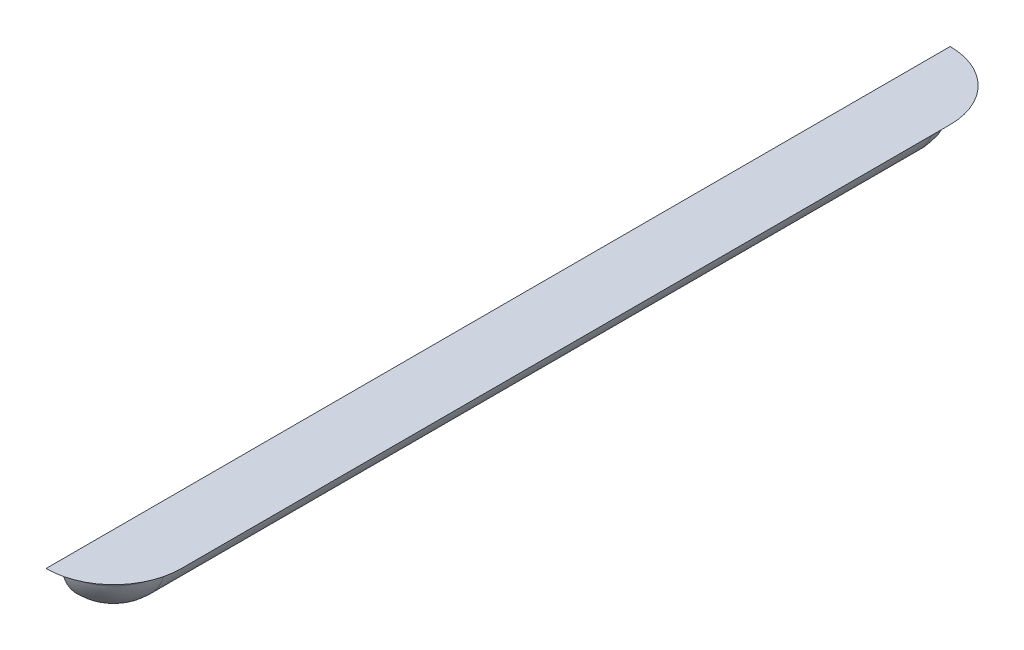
ISO-10303-21;
HEADER;
FILE_DESCRIPTION(('STEP AP214'),'2;1');
FILE_NAME('part.step','',(''),(''),'','','');
FILE_SCHEMA(('AUTOMOTIVE_DESIGN { 1 0 10303 214 1 1 1 1 }'));
ENDSEC;
DATA;
#1=APPLICATION_CONTEXT('core data for automotive mechanical design processes');
#2=APPLICATION_PROTOCOL_DEFINITION('international standard','automotive_design',2000,#1);
#3=PRODUCT_CONTEXT('',#1,'mechanical');
#4=PRODUCT('Part','Part','',(#3));
#5=PRODUCT_RELATED_PRODUCT_CATEGORY('part','',(#4));
#6=PRODUCT_DEFINITION_FORMATION('','',#4);
#7=PRODUCT_DEFINITION_CONTEXT('part definition',#1,'design');
#8=PRODUCT_DEFINITION('design','',#6,#7);
#9=PRODUCT_DEFINITION_SHAPE('','',#8);
#10=(LENGTH_UNIT() NAMED_UNIT(*) SI_UNIT(.MILLI.,.METRE.));
#11=(NAMED_UNIT(*) PLANE_ANGLE_UNIT() SI_UNIT($,.RADIAN.));
#12=(NAMED_UNIT(*) SI_UNIT($,.STERADIAN.) SOLID_ANGLE_UNIT());
#13=UNCERTAINTY_MEASURE_WITH_UNIT(LENGTH_MEASURE(1.E-05),#10,'distance_accuracy_value','');
#14=(GEOMETRIC_REPRESENTATION_CONTEXT(3) GLOBAL_UNCERTAINTY_ASSIGNED_CONTEXT((#13)) GLOBAL_UNIT_ASSIGNED_CONTEXT((#10,
#11,#12)) REPRESENTATION_CONTEXT('',''));
#15=CARTESIAN_POINT('',(0.,0.,0.));
#16=DIRECTION('',(0.,0.,1.));
#17=DIRECTION('',(1.,0.,0.));
#18=AXIS2_PLACEMENT_3D('',#15,#16,#17);
#19=CARTESIAN_POINT('',(-3.,0.,44.));
#20=DIRECTION('',(1.,0.,0.));
#21=DIRECTION('',(0.,0.,-1.));
#22=AXIS2_PLACEMENT_3D('',#19,#20,#21);
#23=PLANE('',#22);
#24=DIRECTION('',(0.,0.,-1.));
#25=VECTOR('',#24,1.);
#26=CARTESIAN_POINT('',(-3.,0.,44.));
#27=LINE('',#26,#25);
#28=CARTESIAN_POINT('',(-3.,0.,51.7459666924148));
#29=VERTEX_POINT('',#28);
#30=CARTESIAN_POINT('',(-3.,0.,-51.7459666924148));
#31=VERTEX_POINT('',#30);
#32=EDGE_CURVE('E93',#29,#31,#27,.T.);
#33=ORIENTED_EDGE('',*,*,#32,.T.);
#34=CARTESIAN_POINT('',(-3.,-2.,-51.7459666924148));
#35=DIRECTION('',(1.,0.,0.));
#36=DIRECTION('',(0.,0.,-1.));
#37=AXIS2_PLACEMENT_3D('',#34,#35,#36);
#38=CIRCLE('',#37,2.);
#39=CARTESIAN_POINT('',(-3.00000000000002,-1.5,-49.8094750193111));
#40=VERTEX_POINT('',#39);
#41=EDGE_CURVE('E12',#31,#40,#38,.T.);
#42=ORIENTED_EDGE('',*,*,#41,.T.);
#43=CARTESIAN_POINT('',(-3.,0.,-44.));
#44=DIRECTION('',(-1.,0.,0.));
#45=DIRECTION('',(0.,0.,1.));
#46=AXIS2_PLACEMENT_3D('',#43,#44,#45);
#47=CIRCLE('',#46,6.);
#48=CARTESIAN_POINT('',(-3.,-6.,-44.));
#49=VERTEX_POINT('',#48);
#50=EDGE_CURVE('E126',#40,#49,#47,.T.);
#51=ORIENTED_EDGE('',*,*,#50,.T.);
#52=DIRECTION('',(0.,0.,-1.));
#53=VECTOR('',#52,1.);
#54=CARTESIAN_POINT('',(-3.,-6.,44.));
#55=LINE('',#54,#53);
#56=CARTESIAN_POINT('',(-3.,-6.,44.));
#57=VERTEX_POINT('',#56);
#58=EDGE_CURVE('E122',#57,#49,#55,.T.);
#59=ORIENTED_EDGE('',*,*,#58,.F.);
#60=CARTESIAN_POINT('',(-3.,0.,44.));
#61=DIRECTION('',(-1.,0.,0.));
#62=DIRECTION('',(0.,0.,1.));
#63=AXIS2_PLACEMENT_3D('',#60,#61,#62);
#64=CIRCLE('',#63,6.);
#65=CARTESIAN_POINT('',(-3.00000000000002,-1.5,49.8094750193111));
#66=VERTEX_POINT('',#65);
#67=EDGE_CURVE('E120',#57,#66,#64,.T.);
#68=ORIENTED_EDGE('',*,*,#67,.T.);
#69=CARTESIAN_POINT('',(-3.,-2.,51.7459666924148));
#70=DIRECTION('',(1.,0.,0.));
#71=DIRECTION('',(0.,0.,-1.));
#72=AXIS2_PLACEMENT_3D('',#69,#70,#71);
#73=CIRCLE('',#72,2.);
#74=EDGE_CURVE('E48',#66,#29,#73,.T.);
#75=ORIENTED_EDGE('',*,*,#74,.T.);
#76=EDGE_LOOP('',(#33,#42,#51,#59,#68,#75));
#77=FACE_BOUND('',#76,.T.);
#78=ADVANCED_FACE('F39',(#77),#23,.F.);
#79=CARTESIAN_POINT('',(-3.,0.,44.));
#80=DIRECTION('',(0.,0.,-1.));
#81=DIRECTION('',(-1.,0.,0.));
#82=AXIS2_PLACEMENT_3D('',#79,#80,#81);
#83=CYLINDRICAL_SURFACE('',#82,6.);
#84=CARTESIAN_POINT('',(-3.,0.,-44.));
#85=DIRECTION('',(0.,0.,1.));
#86=DIRECTION('',(1.,0.,0.));
#87=AXIS2_PLACEMENT_3D('',#84,#85,#86);
#88=CIRCLE('',#87,6.);
#89=CARTESIAN_POINT('',(2.80947501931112,-1.5,-44.));
#90=VERTEX_POINT('',#89);
#91=EDGE_CURVE('E125',#49,#90,#88,.T.);
#92=ORIENTED_EDGE('',*,*,#91,.T.);
#93=DIRECTION('',(0.,0.,-1.));
#94=VECTOR('',#93,1.);
#95=CARTESIAN_POINT('',(2.80947501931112,-1.5,44.));
#96=LINE('',#95,#94);
#97=CARTESIAN_POINT('',(2.80947501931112,-1.5,44.));
#98=VERTEX_POINT('',#97);
#99=EDGE_CURVE('E114',#90,#98,#96,.F.);
#100=ORIENTED_EDGE('',*,*,#99,.T.);
#101=CARTESIAN_POINT('',(-3.,0.,44.));
#102=DIRECTION('',(0.,0.,1.));
#103=DIRECTION('',(1.,0.,0.));
#104=AXIS2_PLACEMENT_3D('',#101,#102,#103);
#105=CIRCLE('',#104,6.);
#106=EDGE_CURVE('E128',#57,#98,#105,.T.);
#107=ORIENTED_EDGE('',*,*,#106,.F.);
#108=ORIENTED_EDGE('',*,*,#58,.T.);
#109=EDGE_LOOP('',(#92,#100,#107,#108));
#110=FACE_BOUND('',#109,.T.);
#111=ADVANCED_FACE('F134',(#110),#83,.T.);
#112=CARTESIAN_POINT('',(-3.,0.,44.));
#113=DIRECTION('',(0.,1.,0.));
#114=DIRECTION('',(0.,0.,1.));
#115=AXIS2_PLACEMENT_3D('',#112,#113,#114);
#116=SPHERICAL_SURFACE('',#115,6.);
#117=ORIENTED_EDGE('',*,*,#106,.T.);
#118=CARTESIAN_POINT('',(-3.,-1.5,44.));
#119=DIRECTION('',(0.,1.,0.));
#120=DIRECTION('',(0.,0.,1.));
#121=AXIS2_PLACEMENT_3D('',#118,#119,#120);
#122=CIRCLE('',#121,5.80947501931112);
#123=EDGE_CURVE('E97',#98,#66,#122,.F.);
#124=ORIENTED_EDGE('',*,*,#123,.T.);
#125=ORIENTED_EDGE('',*,*,#67,.F.);
#126=EDGE_LOOP('',(#117,#124,#125));
#127=FACE_BOUND('',#126,.T.);
#128=ADVANCED_FACE('F135',(#127),#116,.T.);
#129=CARTESIAN_POINT('',(-3.,0.,-44.));
#130=DIRECTION('',(0.,-1.,0.));
#131=DIRECTION('',(0.,0.,-1.));
#132=AXIS2_PLACEMENT_3D('',#129,#130,#131);
#133=SPHERICAL_SURFACE('',#132,6.);
#134=ORIENTED_EDGE('',*,*,#50,.F.);
#135=CARTESIAN_POINT('',(-3.,-1.5,-44.));
#136=DIRECTION('',(0.,1.,0.));
#137=DIRECTION('',(0.,0.,1.));
#138=AXIS2_PLACEMENT_3D('',#135,#136,#137);
#139=CIRCLE('',#138,5.80947501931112);
#140=EDGE_CURVE('E61',#40,#90,#139,.F.);
#141=ORIENTED_EDGE('',*,*,#140,.T.);
#142=ORIENTED_EDGE('',*,*,#91,.F.);
#143=EDGE_LOOP('',(#134,#141,#142));
#144=FACE_BOUND('',#143,.T.);
#145=ADVANCED_FACE('F137',(#144),#133,.T.);
#146=CARTESIAN_POINT('',(-3.,-2.,-44.));
#147=DIRECTION('',(0.,1.,0.));
#148=DIRECTION('',(0.,0.,1.));
#149=AXIS2_PLACEMENT_3D('',#146,#147,#148);
#150=TOROIDAL_SURFACE('',#149,7.74596669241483,2.);
#151=ORIENTED_EDGE('',*,*,#41,.F.);
#152=CARTESIAN_POINT('',(-3.,0.,-44.));
#153=DIRECTION('',(0.,1.,0.));
#154=DIRECTION('',(0.,0.,1.));
#155=AXIS2_PLACEMENT_3D('',#152,#153,#154);
#156=CIRCLE('',#155,7.74596669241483);
#157=CARTESIAN_POINT('',(4.74596669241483,0.,-44.));
#158=VERTEX_POINT('',#157);
#159=EDGE_CURVE('E108',#158,#31,#156,.T.);
#160=ORIENTED_EDGE('',*,*,#159,.F.);
#161=CARTESIAN_POINT('',(4.74596669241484,-2.,-44.));
#162=DIRECTION('',(0.,0.,-1.));
#163=DIRECTION('',(-1.,0.,0.));
#164=AXIS2_PLACEMENT_3D('',#161,#162,#163);
#165=CIRCLE('',#164,2.);
#166=EDGE_CURVE('E43',#90,#158,#165,.T.);
#167=ORIENTED_EDGE('',*,*,#166,.F.);
#168=ORIENTED_EDGE('',*,*,#140,.F.);
#169=EDGE_LOOP('',(#151,#160,#167,#168));
#170=FACE_BOUND('',#169,.T.);
#171=ADVANCED_FACE('F41',(#170),#150,.F.);
#172=CARTESIAN_POINT('',(4.74596669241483,-2.,44.));
#173=DIRECTION('',(0.,0.,-1.));
#174=DIRECTION('',(-1.,0.,0.));
#175=AXIS2_PLACEMENT_3D('',#172,#173,#174);
#176=CYLINDRICAL_SURFACE('',#175,2.);
#177=ORIENTED_EDGE('',*,*,#166,.T.);
#178=DIRECTION('',(0.,0.,1.));
#179=VECTOR('',#178,1.);
#180=CARTESIAN_POINT('',(4.74596669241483,0.,-44.));
#181=LINE('',#180,#179);
#182=CARTESIAN_POINT('',(4.74596669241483,0.,44.));
#183=VERTEX_POINT('',#182);
#184=EDGE_CURVE('E91',#183,#158,#181,.F.);
#185=ORIENTED_EDGE('',*,*,#184,.F.);
#186=CARTESIAN_POINT('',(4.74596669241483,-2.,44.));
#187=DIRECTION('',(0.,0.,-1.));
#188=DIRECTION('',(-1.,0.,0.));
#189=AXIS2_PLACEMENT_3D('',#186,#187,#188);
#190=CIRCLE('',#189,2.);
#191=EDGE_CURVE('E101',#98,#183,#190,.T.);
#192=ORIENTED_EDGE('',*,*,#191,.F.);
#193=ORIENTED_EDGE('',*,*,#99,.F.);
#194=EDGE_LOOP('',(#177,#185,#192,#193));
#195=FACE_BOUND('',#194,.T.);
#196=ADVANCED_FACE('F106',(#195),#176,.F.);
#197=CARTESIAN_POINT('',(-3.,-2.,44.));
#198=DIRECTION('',(0.,1.,0.));
#199=DIRECTION('',(0.,0.,1.));
#200=AXIS2_PLACEMENT_3D('',#197,#198,#199);
#201=TOROIDAL_SURFACE('',#200,7.74596669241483,2.);
#202=ORIENTED_EDGE('',*,*,#74,.F.);
#203=ORIENTED_EDGE('',*,*,#123,.F.);
#204=ORIENTED_EDGE('',*,*,#191,.T.);
#205=CARTESIAN_POINT('',(-3.,0.,44.));
#206=DIRECTION('',(0.,1.,0.));
#207=DIRECTION('',(0.,0.,1.));
#208=AXIS2_PLACEMENT_3D('',#205,#206,#207);
#209=CIRCLE('',#208,7.74596669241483);
#210=EDGE_CURVE('E87',#29,#183,#209,.T.);
#211=ORIENTED_EDGE('',*,*,#210,.F.);
#212=EDGE_LOOP('',(#202,#203,#204,#211));
#213=FACE_BOUND('',#212,.T.);
#214=ADVANCED_FACE('F102',(#213),#201,.F.);
#215=CARTESIAN_POINT('',(15.,0.,-60.));
#216=DIRECTION('',(0.,-1.,0.));
#217=DIRECTION('',(0.,0.,-1.));
#218=AXIS2_PLACEMENT_3D('',#215,#216,#217);
#219=PLANE('',#218);
#220=ORIENTED_EDGE('',*,*,#210,.T.);
#221=ORIENTED_EDGE('',*,*,#184,.T.);
#222=ORIENTED_EDGE('',*,*,#159,.T.);
#223=ORIENTED_EDGE('',*,*,#32,.F.);
#224=EDGE_LOOP('',(#220,#221,#222,#223));
#225=FACE_BOUND('',#224,.T.);
#226=ADVANCED_FACE('F89',(#225),#219,.F.);
#227=CLOSED_SHELL('',(#78,#111,#128,#145,#171,#196,#214,#226));
#228=MANIFOLD_SOLID_BREP('B2',#227);
#229=ADVANCED_BREP_SHAPE_REPRESENTATION('',(#18,#228),#14);
#230=SHAPE_DEFINITION_REPRESENTATION(#9,#229);
ENDSEC;
END-ISO-10303-21;
